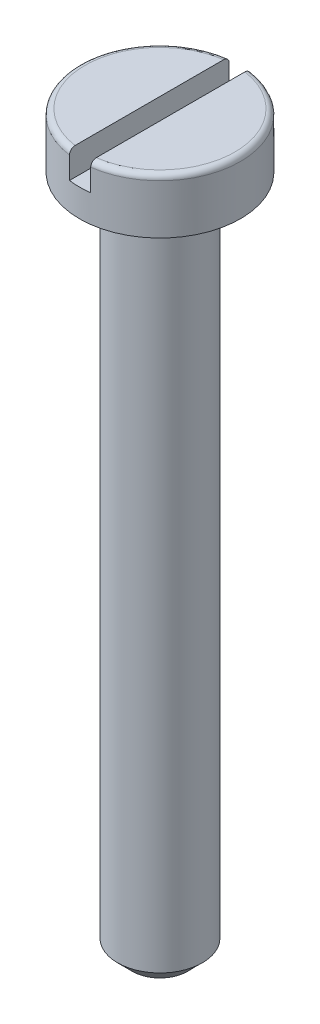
from build123d import *

# Parameters (mm, degrees)
ESQUISSE1_R             = 1
BASE_EXTRUSION_DEPTH    = 16
CHANFREIN1_SIZE         = 0.35
ESQUISSE3_W             = 0.5
ESQUISSE3_H             = 3.8
ENL_V_MAT_EXTRU_1_DEPTH = 0.65


with BuildPart() as part:
    # Esquisse1 → Base-Extrusion (new body)
    with BuildSketch(Plane(origin=(0, 0, 0), x_dir=(1, 0, 0), z_dir=(0, 1, 0))):
        with Locations(Location((0, 0, 0), (0, 0, 270))):
            Circle(ESQUISSE1_R)
    extrude(amount=-BASE_EXTRUSION_DEPTH)

    # Chanfrein1
    chanfrein1_edges = [part.edges().sort_by_distance(p)[0] for p in [
        (0, -16, -1),
    ]]
    chamfer(chanfrein1_edges, length=CHANFREIN1_SIZE)

    # Esquisse2 → Boss.-R_vol.1 (revolve)
    with BuildSketch(Plane.XY, mode=Mode.PRIVATE) as boss_r_vol_1_sk:
        with BuildLine():
            Line((0, 1.3), (0, 0))
            Line((0, 0), (1.9, 0))
            Line((1.9, 0), (1.9, 1.17))
            ThreePointArc((1.9, 1.17), (1.861923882, 1.261923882), (1.77, 1.3))
            Line((1.77, 1.3), (0, 1.3))
        make_face()
    revolve(boss_r_vol_1_sk.sketch.rotate(Axis((0, 1.3, 0), (0, -1, 0)), 90), axis=Axis((0, 1.3, 0), (0, -1, 0)))

    # Esquisse3 → Enl_v. mat.-Extru.1 (cut)
    with BuildSketch(Plane(origin=(0, 1.3, 0), x_dir=(-1, 0, 0), z_dir=(0, 1, 0))):
        Rectangle(ESQUISSE3_W, ESQUISSE3_H)
    extrude(amount=-ENL_V_MAT_EXTRU_1_DEPTH, mode=Mode.SUBTRACT)


solid = part.part
